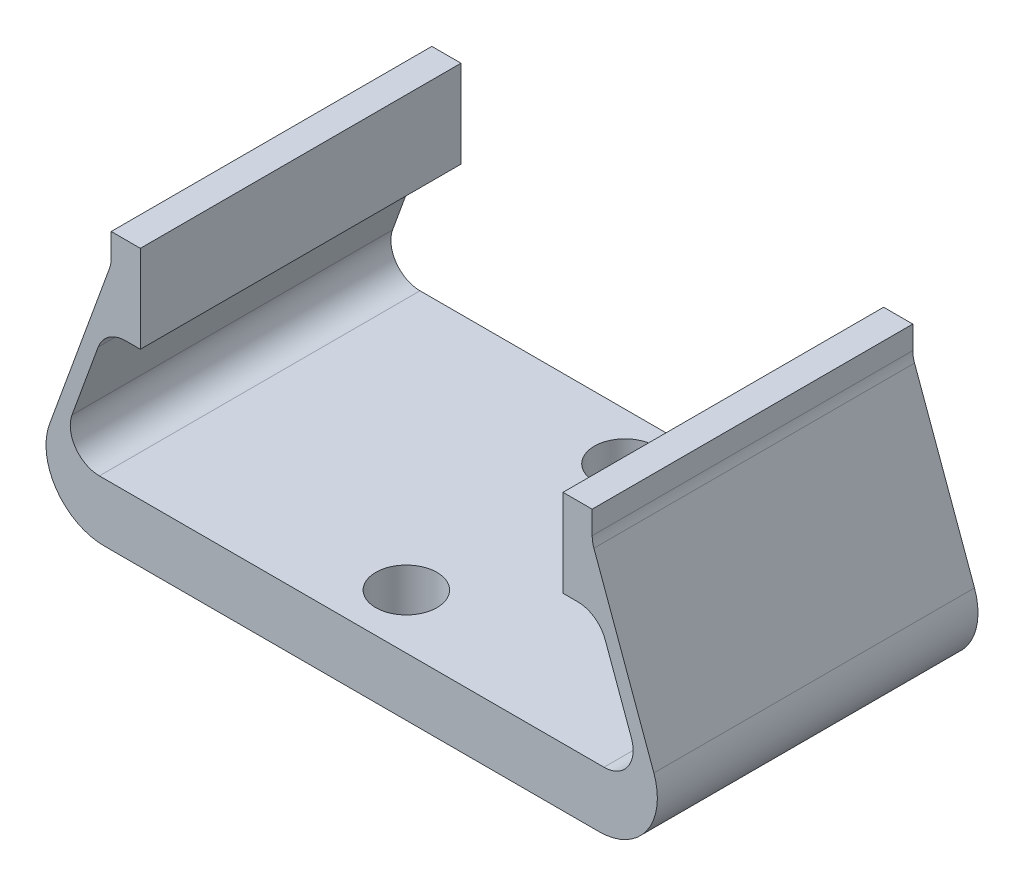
ISO-10303-21;
HEADER;
FILE_DESCRIPTION(('STEP AP214'),'2;1');
FILE_NAME('part.step','',(''),(''),'','','');
FILE_SCHEMA(('AUTOMOTIVE_DESIGN { 1 0 10303 214 1 1 1 1 }'));
ENDSEC;
DATA;
#1=APPLICATION_CONTEXT('core data for automotive mechanical design processes');
#2=APPLICATION_PROTOCOL_DEFINITION('international standard','automotive_design',2000,#1);
#3=PRODUCT_CONTEXT('',#1,'mechanical');
#4=PRODUCT('Part','Part','',(#3));
#5=PRODUCT_RELATED_PRODUCT_CATEGORY('part','',(#4));
#6=PRODUCT_DEFINITION_FORMATION('','',#4);
#7=PRODUCT_DEFINITION_CONTEXT('part definition',#1,'design');
#8=PRODUCT_DEFINITION('design','',#6,#7);
#9=PRODUCT_DEFINITION_SHAPE('','',#8);
#10=(LENGTH_UNIT() NAMED_UNIT(*) SI_UNIT(.MILLI.,.METRE.));
#11=(NAMED_UNIT(*) PLANE_ANGLE_UNIT() SI_UNIT($,.RADIAN.));
#12=(NAMED_UNIT(*) SI_UNIT($,.STERADIAN.) SOLID_ANGLE_UNIT());
#13=UNCERTAINTY_MEASURE_WITH_UNIT(LENGTH_MEASURE(1.E-05),#10,'distance_accuracy_value','');
#14=(GEOMETRIC_REPRESENTATION_CONTEXT(3) GLOBAL_UNCERTAINTY_ASSIGNED_CONTEXT((#13)) GLOBAL_UNIT_ASSIGNED_CONTEXT((#10,
#11,#12)) REPRESENTATION_CONTEXT('',''));
#15=CARTESIAN_POINT('',(0.,0.,0.));
#16=DIRECTION('',(0.,0.,1.));
#17=DIRECTION('',(1.,0.,0.));
#18=AXIS2_PLACEMENT_3D('',#15,#16,#17);
#19=CARTESIAN_POINT('',(0.,0.,22.));
#20=DIRECTION('',(0.,1.,0.));
#21=DIRECTION('',(0.,0.,1.));
#22=AXIS2_PLACEMENT_3D('',#19,#20,#21);
#23=PLANE('',#22);
#24=CARTESIAN_POINT('',(0.,0.,18.25));
#25=DIRECTION('',(0.,-1.,0.));
#26=DIRECTION('',(0.,0.,-1.));
#27=AXIS2_PLACEMENT_3D('',#24,#25,#26);
#28=CIRCLE('',#27,2.1);
#29=CARTESIAN_POINT('',(0.,0.,16.15));
#30=VERTEX_POINT('',#29);
#31=EDGE_CURVE('E362',#30,#30,#28,.T.);
#32=ORIENTED_EDGE('',*,*,#31,.F.);
#33=EDGE_LOOP('',(#32));
#34=FACE_BOUND('',#33,.T.);
#35=CARTESIAN_POINT('',(0.,0.,3.25));
#36=DIRECTION('',(0.,-1.,0.));
#37=DIRECTION('',(0.,0.,-1.));
#38=AXIS2_PLACEMENT_3D('',#35,#36,#37);
#39=CIRCLE('',#38,2.1);
#40=CARTESIAN_POINT('',(0.,0.,1.15));
#41=VERTEX_POINT('',#40);
#42=EDGE_CURVE('E354',#41,#41,#39,.T.);
#43=ORIENTED_EDGE('',*,*,#42,.F.);
#44=EDGE_LOOP('',(#43));
#45=FACE_BOUND('',#44,.T.);
#46=DIRECTION('',(1.,0.,0.));
#47=VECTOR('',#46,1.);
#48=CARTESIAN_POINT('',(0.,0.,22.));
#49=LINE('',#48,#47);
#50=CARTESIAN_POINT('',(-16.974901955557,0.,22.));
#51=VERTEX_POINT('',#50);
#52=CARTESIAN_POINT('',(16.974901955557,0.,22.));
#53=VERTEX_POINT('',#52);
#54=EDGE_CURVE('E240',#51,#53,#49,.T.);
#55=ORIENTED_EDGE('',*,*,#54,.F.);
#56=DIRECTION('',(0.,0.,-1.));
#57=VECTOR('',#56,1.);
#58=CARTESIAN_POINT('',(-16.974901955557,0.,0.));
#59=LINE('',#58,#57);
#60=CARTESIAN_POINT('',(-16.974901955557,0.,0.));
#61=VERTEX_POINT('',#60);
#62=EDGE_CURVE('E324',#51,#61,#59,.T.);
#63=ORIENTED_EDGE('',*,*,#62,.T.);
#64=DIRECTION('',(1.,0.,0.));
#65=VECTOR('',#64,1.);
#66=CARTESIAN_POINT('',(0.,0.,0.));
#67=LINE('',#66,#65);
#68=CARTESIAN_POINT('',(16.974901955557,0.,0.));
#69=VERTEX_POINT('',#68);
#70=EDGE_CURVE('E196',#61,#69,#67,.T.);
#71=ORIENTED_EDGE('',*,*,#70,.T.);
#72=DIRECTION('',(0.,0.,-1.));
#73=VECTOR('',#72,1.);
#74=CARTESIAN_POINT('',(16.974901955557,0.,22.));
#75=LINE('',#74,#73);
#76=EDGE_CURVE('E292',#69,#53,#75,.F.);
#77=ORIENTED_EDGE('',*,*,#76,.T.);
#78=EDGE_LOOP('',(#55,#63,#71,#77));
#79=FACE_BOUND('',#78,.T.);
#80=ADVANCED_FACE('F33',(#34,#45,#79),#23,.F.);
#81=CARTESIAN_POINT('',(22.6874939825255,0.,22.));
#82=DIRECTION('',(-0.939692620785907,-0.342020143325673,0.));
#83=DIRECTION('',(0.342020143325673,-0.939692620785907,0.));
#84=AXIS2_PLACEMENT_3D('',#81,#82,#83);
#85=PLANE('',#84);
#86=DIRECTION('',(-0.342020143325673,0.939692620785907,0.));
#87=VECTOR('',#86,1.);
#88=CARTESIAN_POINT('',(22.6874939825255,0.,0.));
#89=LINE('',#88,#87);
#90=CARTESIAN_POINT('',(20.7336724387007,5.36808057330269,0.));
#91=VERTEX_POINT('',#90);
#92=CARTESIAN_POINT('',(16.6206147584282,16.6686136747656,0.));
#93=VERTEX_POINT('',#92);
#94=EDGE_CURVE('E262',#91,#93,#89,.T.);
#95=ORIENTED_EDGE('',*,*,#94,.T.);
#96=DIRECTION('',(0.,0.,-1.));
#97=VECTOR('',#96,1.);
#98=CARTESIAN_POINT('',(16.6206147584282,16.6686136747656,22.));
#99=LINE('',#98,#97);
#100=CARTESIAN_POINT('',(16.6206147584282,16.6686136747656,22.));
#101=VERTEX_POINT('',#100);
#102=EDGE_CURVE('E300',#93,#101,#99,.F.);
#103=ORIENTED_EDGE('',*,*,#102,.T.);
#104=DIRECTION('',(-0.342020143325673,0.939692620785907,0.));
#105=VECTOR('',#104,1.);
#106=CARTESIAN_POINT('',(22.6874939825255,0.,22.));
#107=LINE('',#106,#105);
#108=CARTESIAN_POINT('',(20.7336724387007,5.36808057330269,22.));
#109=VERTEX_POINT('',#108);
#110=EDGE_CURVE('E242',#109,#101,#107,.T.);
#111=ORIENTED_EDGE('',*,*,#110,.F.);
#112=DIRECTION('',(0.,0.,-1.));
#113=VECTOR('',#112,1.);
#114=CARTESIAN_POINT('',(20.7336724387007,5.36808057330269,22.));
#115=LINE('',#114,#113);
#116=EDGE_CURVE('E286',#109,#91,#115,.T.);
#117=ORIENTED_EDGE('',*,*,#116,.T.);
#118=EDGE_LOOP('',(#95,#103,#111,#117));
#119=FACE_BOUND('',#118,.T.);
#120=ADVANCED_FACE('F415',(#119),#85,.F.);
#121=CARTESIAN_POINT('',(16.5,18.9299823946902,22.));
#122=DIRECTION('',(-1.,0.,0.));
#123=DIRECTION('',(0.,-1.,0.));
#124=AXIS2_PLACEMENT_3D('',#121,#122,#123);
#125=PLANE('',#124);
#126=DIRECTION('',(0.,1.,0.));
#127=VECTOR('',#126,1.);
#128=CARTESIAN_POINT('',(16.5,18.9299823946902,22.));
#129=LINE('',#128,#127);
#130=CARTESIAN_POINT('',(16.5,17.3526539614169,22.));
#131=VERTEX_POINT('',#130);
#132=CARTESIAN_POINT('',(16.5,18.9299823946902,22.));
#133=VERTEX_POINT('',#132);
#134=EDGE_CURVE('E246',#131,#133,#129,.T.);
#135=ORIENTED_EDGE('',*,*,#134,.F.);
#136=DIRECTION('',(0.,0.,-1.));
#137=VECTOR('',#136,1.);
#138=CARTESIAN_POINT('',(16.5,17.3526539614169,0.));
#139=LINE('',#138,#137);
#140=CARTESIAN_POINT('',(16.5,17.3526539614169,0.));
#141=VERTEX_POINT('',#140);
#142=EDGE_CURVE('E297',#131,#141,#139,.T.);
#143=ORIENTED_EDGE('',*,*,#142,.T.);
#144=DIRECTION('',(0.,1.,0.));
#145=VECTOR('',#144,1.);
#146=CARTESIAN_POINT('',(16.5,18.9299823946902,0.));
#147=LINE('',#146,#145);
#148=CARTESIAN_POINT('',(16.5,18.9299823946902,0.));
#149=VERTEX_POINT('',#148);
#150=EDGE_CURVE('E265',#141,#149,#147,.T.);
#151=ORIENTED_EDGE('',*,*,#150,.T.);
#152=DIRECTION('',(0.,0.,-1.));
#153=VECTOR('',#152,1.);
#154=CARTESIAN_POINT('',(16.5,18.9299823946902,22.));
#155=LINE('',#154,#153);
#156=EDGE_CURVE('E283',#133,#149,#155,.T.);
#157=ORIENTED_EDGE('',*,*,#156,.F.);
#158=EDGE_LOOP('',(#135,#143,#151,#157));
#159=FACE_BOUND('',#158,.T.);
#160=ADVANCED_FACE('F407',(#159),#125,.F.);
#161=CARTESIAN_POINT('',(14.5,18.9299823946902,22.));
#162=DIRECTION('',(0.,-1.,0.));
#163=DIRECTION('',(1.,0.,0.));
#164=AXIS2_PLACEMENT_3D('',#161,#162,#163);
#165=PLANE('',#164);
#166=DIRECTION('',(-1.,0.,0.));
#167=VECTOR('',#166,1.);
#168=CARTESIAN_POINT('',(14.5,18.9299823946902,0.));
#169=LINE('',#168,#167);
#170=CARTESIAN_POINT('',(14.5,18.9299823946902,0.));
#171=VERTEX_POINT('',#170);
#172=EDGE_CURVE('E267',#149,#171,#169,.T.);
#173=ORIENTED_EDGE('',*,*,#172,.T.);
#174=DIRECTION('',(0.,0.,-1.));
#175=VECTOR('',#174,1.);
#176=CARTESIAN_POINT('',(14.5,18.9299823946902,22.));
#177=LINE('',#176,#175);
#178=CARTESIAN_POINT('',(14.5,18.9299823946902,22.));
#179=VERTEX_POINT('',#178);
#180=EDGE_CURVE('E280',#179,#171,#177,.T.);
#181=ORIENTED_EDGE('',*,*,#180,.F.);
#182=DIRECTION('',(-1.,0.,0.));
#183=VECTOR('',#182,1.);
#184=CARTESIAN_POINT('',(14.5,18.9299823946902,22.));
#185=LINE('',#184,#183);
#186=EDGE_CURVE('E248',#133,#179,#185,.T.);
#187=ORIENTED_EDGE('',*,*,#186,.F.);
#188=ORIENTED_EDGE('',*,*,#156,.T.);
#189=EDGE_LOOP('',(#173,#181,#187,#188));
#190=FACE_BOUND('',#189,.T.);
#191=ADVANCED_FACE('F402',(#190),#165,.F.);
#192=CARTESIAN_POINT('',(14.5,12.9299823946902,22.));
#193=DIRECTION('',(1.,0.,0.));
#194=DIRECTION('',(0.,0.,-1.));
#195=AXIS2_PLACEMENT_3D('',#192,#193,#194);
#196=PLANE('',#195);
#197=DIRECTION('',(0.,-1.,0.));
#198=VECTOR('',#197,1.);
#199=CARTESIAN_POINT('',(14.5,12.9299823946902,0.));
#200=LINE('',#199,#198);
#201=CARTESIAN_POINT('',(14.5,12.9299823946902,0.));
#202=VERTEX_POINT('',#201);
#203=EDGE_CURVE('E269',#171,#202,#200,.T.);
#204=ORIENTED_EDGE('',*,*,#203,.T.);
#205=DIRECTION('',(0.,0.,-1.));
#206=VECTOR('',#205,1.);
#207=CARTESIAN_POINT('',(14.5,12.9299823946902,22.));
#208=LINE('',#207,#206);
#209=CARTESIAN_POINT('',(14.5,12.9299823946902,22.));
#210=VERTEX_POINT('',#209);
#211=EDGE_CURVE('E260',#210,#202,#208,.T.);
#212=ORIENTED_EDGE('',*,*,#211,.F.);
#213=DIRECTION('',(0.,-1.,0.));
#214=VECTOR('',#213,1.);
#215=CARTESIAN_POINT('',(14.5,12.9299823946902,22.));
#216=LINE('',#215,#214);
#217=EDGE_CURVE('E250',#179,#210,#216,.T.);
#218=ORIENTED_EDGE('',*,*,#217,.F.);
#219=ORIENTED_EDGE('',*,*,#180,.T.);
#220=EDGE_LOOP('',(#204,#212,#218,#219));
#221=FACE_BOUND('',#220,.T.);
#222=ADVANCED_FACE('F397',(#221),#196,.F.);
#223=CARTESIAN_POINT('',(14.5,12.9299823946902,22.));
#224=DIRECTION('',(0.,1.,0.));
#225=DIRECTION('',(0.,0.,1.));
#226=AXIS2_PLACEMENT_3D('',#223,#224,#225);
#227=PLANE('',#226);
#228=DIRECTION('',(1.,0.,0.));
#229=VECTOR('',#228,1.);
#230=CARTESIAN_POINT('',(14.5,12.9299823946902,0.));
#231=LINE('',#230,#229);
#232=CARTESIAN_POINT('',(15.5167724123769,12.9299823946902,0.));
#233=VERTEX_POINT('',#232);
#234=EDGE_CURVE('E271',#202,#233,#231,.T.);
#235=ORIENTED_EDGE('',*,*,#234,.T.);
#236=DIRECTION('',(0.,0.,-1.));
#237=VECTOR('',#236,1.);
#238=CARTESIAN_POINT('',(15.5167724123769,12.9299823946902,22.));
#239=LINE('',#238,#237);
#240=CARTESIAN_POINT('',(15.5167724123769,12.9299823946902,22.));
#241=VERTEX_POINT('',#240);
#242=EDGE_CURVE('E307',#233,#241,#239,.F.);
#243=ORIENTED_EDGE('',*,*,#242,.T.);
#244=DIRECTION('',(1.,0.,0.));
#245=VECTOR('',#244,1.);
#246=CARTESIAN_POINT('',(14.5,12.9299823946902,22.));
#247=LINE('',#246,#245);
#248=EDGE_CURVE('E252',#210,#241,#247,.T.);
#249=ORIENTED_EDGE('',*,*,#248,.F.);
#250=ORIENTED_EDGE('',*,*,#211,.T.);
#251=EDGE_LOOP('',(#235,#243,#249,#250));
#252=FACE_BOUND('',#251,.T.);
#253=ADVANCED_FACE('F392',(#252),#227,.F.);
#254=CARTESIAN_POINT('',(16.9171874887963,12.9299823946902,22.));
#255=DIRECTION('',(0.939692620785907,0.342020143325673,0.));
#256=DIRECTION('',(-0.342020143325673,0.939692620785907,0.));
#257=AXIS2_PLACEMENT_3D('',#254,#255,#256);
#258=PLANE('',#257);
#259=DIRECTION('',(0.342020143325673,-0.939692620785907,0.));
#260=VECTOR('',#259,1.);
#261=CARTESIAN_POINT('',(16.9171874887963,12.9299823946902,22.));
#262=LINE('',#261,#260);
#263=CARTESIAN_POINT('',(17.3961576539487,11.6140226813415,22.));
#264=VERTEX_POINT('',#263);
#265=CARTESIAN_POINT('',(19.1905245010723,6.68404028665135,22.));
#266=VERTEX_POINT('',#265);
#267=EDGE_CURVE('E255',#264,#266,#262,.T.);
#268=ORIENTED_EDGE('',*,*,#267,.F.);
#269=DIRECTION('',(0.,0.,-1.));
#270=VECTOR('',#269,1.);
#271=CARTESIAN_POINT('',(17.3961576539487,11.6140226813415,0.));
#272=LINE('',#271,#270);
#273=CARTESIAN_POINT('',(17.3961576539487,11.6140226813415,0.));
#274=VERTEX_POINT('',#273);
#275=EDGE_CURVE('E304',#264,#274,#272,.T.);
#276=ORIENTED_EDGE('',*,*,#275,.T.);
#277=DIRECTION('',(0.342020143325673,-0.939692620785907,0.));
#278=VECTOR('',#277,1.);
#279=CARTESIAN_POINT('',(16.9171874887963,12.9299823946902,0.));
#280=LINE('',#279,#278);
#281=CARTESIAN_POINT('',(19.1905245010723,6.68404028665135,0.));
#282=VERTEX_POINT('',#281);
#283=EDGE_CURVE('E274',#274,#282,#280,.T.);
#284=ORIENTED_EDGE('',*,*,#283,.T.);
#285=DIRECTION('',(0.,0.,-1.));
#286=VECTOR('',#285,1.);
#287=CARTESIAN_POINT('',(19.1905245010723,6.68404028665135,22.));
#288=LINE('',#287,#286);
#289=EDGE_CURVE('E302',#282,#266,#288,.F.);
#290=ORIENTED_EDGE('',*,*,#289,.T.);
#291=EDGE_LOOP('',(#268,#276,#284,#290));
#292=FACE_BOUND('',#291,.T.);
#293=ADVANCED_FACE('F383',(#292),#258,.F.);
#294=CARTESIAN_POINT('',(20.1674352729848,4.,22.));
#295=DIRECTION('',(0.,-1.,0.));
#296=DIRECTION('',(1.,0.,0.));
#297=AXIS2_PLACEMENT_3D('',#294,#295,#296);
#298=PLANE('',#297);
#299=CARTESIAN_POINT('',(0.,4.,18.25));
#300=DIRECTION('',(0.,-1.,0.));
#301=DIRECTION('',(1.,0.,0.));
#302=AXIS2_PLACEMENT_3D('',#299,#300,#301);
#303=CIRCLE('',#302,2.1);
#304=CARTESIAN_POINT('',(2.1,4.,18.25));
#305=VERTEX_POINT('',#304);
#306=EDGE_CURVE('E37',#305,#305,#303,.T.);
#307=ORIENTED_EDGE('',*,*,#306,.T.);
#308=EDGE_LOOP('',(#307));
#309=FACE_BOUND('',#308,.T.);
#310=CARTESIAN_POINT('',(0.,4.,3.25));
#311=DIRECTION('',(0.,-1.,0.));
#312=DIRECTION('',(1.,0.,0.));
#313=AXIS2_PLACEMENT_3D('',#310,#311,#312);
#314=CIRCLE('',#313,2.1);
#315=CARTESIAN_POINT('',(2.1,4.,3.25));
#316=VERTEX_POINT('',#315);
#317=EDGE_CURVE('E225',#316,#316,#314,.T.);
#318=ORIENTED_EDGE('',*,*,#317,.T.);
#319=EDGE_LOOP('',(#318));
#320=FACE_BOUND('',#319,.T.);
#321=DIRECTION('',(-1.,0.,0.));
#322=VECTOR('',#321,1.);
#323=CARTESIAN_POINT('',(20.1674352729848,4.,0.));
#324=LINE('',#323,#322);
#325=CARTESIAN_POINT('',(17.3111392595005,4.,0.));
#326=VERTEX_POINT('',#325);
#327=CARTESIAN_POINT('',(-17.3111392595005,4.,0.));
#328=VERTEX_POINT('',#327);
#329=EDGE_CURVE('E243',#326,#328,#324,.T.);
#330=ORIENTED_EDGE('',*,*,#329,.T.);
#331=DIRECTION('',(0.,0.,-1.));
#332=VECTOR('',#331,1.);
#333=CARTESIAN_POINT('',(-17.3111392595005,4.,22.));
#334=LINE('',#333,#332);
#335=CARTESIAN_POINT('',(-17.3111392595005,4.,22.));
#336=VERTEX_POINT('',#335);
#337=EDGE_CURVE('E56',#328,#336,#334,.F.);
#338=ORIENTED_EDGE('',*,*,#337,.T.);
#339=DIRECTION('',(-1.,0.,0.));
#340=VECTOR('',#339,1.);
#341=CARTESIAN_POINT('',(20.1674352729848,4.,22.));
#342=LINE('',#341,#340);
#343=CARTESIAN_POINT('',(17.3111392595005,4.,22.));
#344=VERTEX_POINT('',#343);
#345=EDGE_CURVE('E258',#344,#336,#342,.T.);
#346=ORIENTED_EDGE('',*,*,#345,.F.);
#347=DIRECTION('',(0.,0.,-1.));
#348=VECTOR('',#347,1.);
#349=CARTESIAN_POINT('',(17.3111392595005,4.,0.));
#350=LINE('',#349,#348);
#351=EDGE_CURVE('E309',#344,#326,#350,.T.);
#352=ORIENTED_EDGE('',*,*,#351,.T.);
#353=EDGE_LOOP('',(#330,#338,#346,#352));
#354=FACE_BOUND('',#353,.T.);
#355=ADVANCED_FACE('F374',(#309,#320,#354),#298,.F.);
#356=CARTESIAN_POINT('',(0.,0.,22.));
#357=DIRECTION('',(0.,0.,1.));
#358=DIRECTION('',(1.,0.,0.));
#359=AXIS2_PLACEMENT_3D('',#356,#357,#358);
#360=PLANE('',#359);
#361=DIRECTION('',(0.342020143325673,0.939692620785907,0.));
#362=VECTOR('',#361,1.);
#363=CARTESIAN_POINT('',(-22.6874939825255,0.,22.));
#364=LINE('',#363,#362);
#365=CARTESIAN_POINT('',(-20.7336724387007,5.36808057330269,22.));
#366=VERTEX_POINT('',#365);
#367=CARTESIAN_POINT('',(-16.6206147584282,16.6686136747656,22.));
#368=VERTEX_POINT('',#367);
#369=EDGE_CURVE('E219',#366,#368,#364,.T.);
#370=ORIENTED_EDGE('',*,*,#369,.F.);
#371=CARTESIAN_POINT('',(-16.974901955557,4.,22.));
#372=DIRECTION('',(0.,0.,1.));
#373=DIRECTION('',(1.,0.,0.));
#374=AXIS2_PLACEMENT_3D('',#371,#372,#373);
#375=CIRCLE('',#374,4.);
#376=EDGE_CURVE('E331',#366,#51,#375,.T.);
#377=ORIENTED_EDGE('',*,*,#376,.T.);
#378=ORIENTED_EDGE('',*,*,#54,.T.);
#379=CARTESIAN_POINT('',(16.974901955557,4.,22.));
#380=DIRECTION('',(0.,0.,1.));
#381=DIRECTION('',(1.,0.,0.));
#382=AXIS2_PLACEMENT_3D('',#379,#380,#381);
#383=CIRCLE('',#382,4.);
#384=EDGE_CURVE('E295',#53,#109,#383,.T.);
#385=ORIENTED_EDGE('',*,*,#384,.T.);
#386=ORIENTED_EDGE('',*,*,#110,.T.);
#387=CARTESIAN_POINT('',(18.5,17.3526539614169,22.));
#388=DIRECTION('',(0.,0.,1.));
#389=DIRECTION('',(1.,0.,0.));
#390=AXIS2_PLACEMENT_3D('',#387,#388,#389);
#391=CIRCLE('',#390,2.);
#392=EDGE_CURVE('E314',#101,#131,#391,.F.);
#393=ORIENTED_EDGE('',*,*,#392,.T.);
#394=ORIENTED_EDGE('',*,*,#134,.T.);
#395=ORIENTED_EDGE('',*,*,#186,.T.);
#396=ORIENTED_EDGE('',*,*,#217,.T.);
#397=ORIENTED_EDGE('',*,*,#248,.T.);
#398=CARTESIAN_POINT('',(15.5167724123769,10.9299823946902,22.));
#399=DIRECTION('',(0.,0.,1.));
#400=DIRECTION('',(1.,0.,0.));
#401=AXIS2_PLACEMENT_3D('',#398,#399,#400);
#402=CIRCLE('',#401,2.);
#403=EDGE_CURVE('E318',#241,#264,#402,.F.);
#404=ORIENTED_EDGE('',*,*,#403,.T.);
#405=ORIENTED_EDGE('',*,*,#267,.T.);
#406=CARTESIAN_POINT('',(17.3111392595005,6.,22.));
#407=DIRECTION('',(0.,0.,1.));
#408=DIRECTION('',(1.,0.,0.));
#409=AXIS2_PLACEMENT_3D('',#406,#407,#408);
#410=CIRCLE('',#409,2.);
#411=EDGE_CURVE('E322',#266,#344,#410,.F.);
#412=ORIENTED_EDGE('',*,*,#411,.T.);
#413=ORIENTED_EDGE('',*,*,#345,.T.);
#414=CARTESIAN_POINT('',(-17.3111392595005,6.,22.));
#415=DIRECTION('',(0.,0.,1.));
#416=DIRECTION('',(1.,0.,0.));
#417=AXIS2_PLACEMENT_3D('',#414,#415,#416);
#418=CIRCLE('',#417,2.);
#419=CARTESIAN_POINT('',(-19.1905245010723,6.68404028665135,22.));
#420=VERTEX_POINT('',#419);
#421=EDGE_CURVE('E11',#336,#420,#418,.F.);
#422=ORIENTED_EDGE('',*,*,#421,.T.);
#423=DIRECTION('',(-0.342020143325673,-0.939692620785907,0.));
#424=VECTOR('',#423,1.);
#425=CARTESIAN_POINT('',(-16.9171874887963,12.9299823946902,22.));
#426=LINE('',#425,#424);
#427=CARTESIAN_POINT('',(-17.3961576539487,11.6140226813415,22.));
#428=VERTEX_POINT('',#427);
#429=EDGE_CURVE('E209',#428,#420,#426,.T.);
#430=ORIENTED_EDGE('',*,*,#429,.F.);
#431=CARTESIAN_POINT('',(-15.5167724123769,10.9299823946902,22.));
#432=DIRECTION('',(0.,0.,1.));
#433=DIRECTION('',(1.,0.,0.));
#434=AXIS2_PLACEMENT_3D('',#431,#432,#433);
#435=CIRCLE('',#434,2.);
#436=CARTESIAN_POINT('',(-15.5167724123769,12.9299823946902,22.));
#437=VERTEX_POINT('',#436);
#438=EDGE_CURVE('E208',#428,#437,#435,.F.);
#439=ORIENTED_EDGE('',*,*,#438,.T.);
#440=DIRECTION('',(-1.,0.,0.));
#441=VECTOR('',#440,1.);
#442=CARTESIAN_POINT('',(-14.5,12.9299823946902,22.));
#443=LINE('',#442,#441);
#444=CARTESIAN_POINT('',(-14.5,12.9299823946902,22.));
#445=VERTEX_POINT('',#444);
#446=EDGE_CURVE('E188',#445,#437,#443,.T.);
#447=ORIENTED_EDGE('',*,*,#446,.F.);
#448=DIRECTION('',(0.,-1.,0.));
#449=VECTOR('',#448,1.);
#450=CARTESIAN_POINT('',(-14.5,12.9299823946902,22.));
#451=LINE('',#450,#449);
#452=CARTESIAN_POINT('',(-14.5,18.9299823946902,22.));
#453=VERTEX_POINT('',#452);
#454=EDGE_CURVE('E204',#453,#445,#451,.T.);
#455=ORIENTED_EDGE('',*,*,#454,.F.);
#456=DIRECTION('',(1.,0.,0.));
#457=VECTOR('',#456,1.);
#458=CARTESIAN_POINT('',(-14.5,18.9299823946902,22.));
#459=LINE('',#458,#457);
#460=CARTESIAN_POINT('',(-16.5,18.9299823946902,22.));
#461=VERTEX_POINT('',#460);
#462=EDGE_CURVE('E212',#461,#453,#459,.T.);
#463=ORIENTED_EDGE('',*,*,#462,.F.);
#464=DIRECTION('',(0.,1.,0.));
#465=VECTOR('',#464,1.);
#466=CARTESIAN_POINT('',(-16.5,18.9299823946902,22.));
#467=LINE('',#466,#465);
#468=CARTESIAN_POINT('',(-16.5,17.3526539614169,22.));
#469=VERTEX_POINT('',#468);
#470=EDGE_CURVE('E214',#469,#461,#467,.T.);
#471=ORIENTED_EDGE('',*,*,#470,.F.);
#472=CARTESIAN_POINT('',(-18.5,17.3526539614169,22.));
#473=DIRECTION('',(0.,0.,1.));
#474=DIRECTION('',(1.,0.,0.));
#475=AXIS2_PLACEMENT_3D('',#472,#473,#474);
#476=CIRCLE('',#475,2.);
#477=EDGE_CURVE('E348',#469,#368,#476,.F.);
#478=ORIENTED_EDGE('',*,*,#477,.T.);
#479=EDGE_LOOP('',(#370,#377,#378,#385,#386,#393,#394,#395,#396,#397,#404,#405,#412,#413,#422,
#430,#439,#447,#455,#463,#471,#478));
#480=FACE_BOUND('',#479,.T.);
#481=ADVANCED_FACE('F202',(#480),#360,.T.);
#482=CARTESIAN_POINT('',(0.,0.,0.));
#483=DIRECTION('',(0.,0.,1.));
#484=DIRECTION('',(1.,0.,0.));
#485=AXIS2_PLACEMENT_3D('',#482,#483,#484);
#486=PLANE('',#485);
#487=ORIENTED_EDGE('',*,*,#70,.F.);
#488=CARTESIAN_POINT('',(-16.974901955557,4.,0.));
#489=DIRECTION('',(0.,0.,1.));
#490=DIRECTION('',(1.,0.,0.));
#491=AXIS2_PLACEMENT_3D('',#488,#489,#490);
#492=CIRCLE('',#491,4.);
#493=CARTESIAN_POINT('',(-20.7336724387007,5.36808057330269,0.));
#494=VERTEX_POINT('',#493);
#495=EDGE_CURVE('E327',#61,#494,#492,.F.);
#496=ORIENTED_EDGE('',*,*,#495,.T.);
#497=DIRECTION('',(0.342020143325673,0.939692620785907,0.));
#498=VECTOR('',#497,1.);
#499=CARTESIAN_POINT('',(-22.6874939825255,0.,0.));
#500=LINE('',#499,#498);
#501=CARTESIAN_POINT('',(-16.6206147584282,16.6686136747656,0.));
#502=VERTEX_POINT('',#501);
#503=EDGE_CURVE('E234',#494,#502,#500,.T.);
#504=ORIENTED_EDGE('',*,*,#503,.T.);
#505=CARTESIAN_POINT('',(-18.5,17.3526539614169,0.));
#506=DIRECTION('',(0.,0.,1.));
#507=DIRECTION('',(1.,0.,0.));
#508=AXIS2_PLACEMENT_3D('',#505,#506,#507);
#509=CIRCLE('',#508,2.);
#510=CARTESIAN_POINT('',(-16.5,17.3526539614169,0.));
#511=VERTEX_POINT('',#510);
#512=EDGE_CURVE('E346',#502,#511,#509,.T.);
#513=ORIENTED_EDGE('',*,*,#512,.T.);
#514=DIRECTION('',(0.,1.,0.));
#515=VECTOR('',#514,1.);
#516=CARTESIAN_POINT('',(-16.5,18.9299823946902,0.));
#517=LINE('',#516,#515);
#518=CARTESIAN_POINT('',(-16.5,18.9299823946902,0.));
#519=VERTEX_POINT('',#518);
#520=EDGE_CURVE('E232',#511,#519,#517,.T.);
#521=ORIENTED_EDGE('',*,*,#520,.T.);
#522=DIRECTION('',(1.,0.,0.));
#523=VECTOR('',#522,1.);
#524=CARTESIAN_POINT('',(-14.5,18.9299823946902,0.));
#525=LINE('',#524,#523);
#526=CARTESIAN_POINT('',(-14.5,18.9299823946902,0.));
#527=VERTEX_POINT('',#526);
#528=EDGE_CURVE('E229',#519,#527,#525,.T.);
#529=ORIENTED_EDGE('',*,*,#528,.T.);
#530=DIRECTION('',(0.,-1.,0.));
#531=VECTOR('',#530,1.);
#532=CARTESIAN_POINT('',(-14.5,12.9299823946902,0.));
#533=LINE('',#532,#531);
#534=CARTESIAN_POINT('',(-14.5,12.9299823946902,0.));
#535=VERTEX_POINT('',#534);
#536=EDGE_CURVE('E227',#527,#535,#533,.T.);
#537=ORIENTED_EDGE('',*,*,#536,.T.);
#538=DIRECTION('',(-1.,0.,0.));
#539=VECTOR('',#538,1.);
#540=CARTESIAN_POINT('',(-14.5,12.9299823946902,0.));
#541=LINE('',#540,#539);
#542=CARTESIAN_POINT('',(-15.5167724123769,12.9299823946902,0.));
#543=VERTEX_POINT('',#542);
#544=EDGE_CURVE('E191',#535,#543,#541,.T.);
#545=ORIENTED_EDGE('',*,*,#544,.T.);
#546=CARTESIAN_POINT('',(-15.5167724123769,10.9299823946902,0.));
#547=DIRECTION('',(0.,0.,1.));
#548=DIRECTION('',(1.,0.,0.));
#549=AXIS2_PLACEMENT_3D('',#546,#547,#548);
#550=CIRCLE('',#549,2.);
#551=CARTESIAN_POINT('',(-17.3961576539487,11.6140226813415,0.));
#552=VERTEX_POINT('',#551);
#553=EDGE_CURVE('E350',#543,#552,#550,.T.);
#554=ORIENTED_EDGE('',*,*,#553,.T.);
#555=DIRECTION('',(-0.342020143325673,-0.939692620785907,0.));
#556=VECTOR('',#555,1.);
#557=CARTESIAN_POINT('',(-16.9171874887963,12.9299823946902,0.));
#558=LINE('',#557,#556);
#559=CARTESIAN_POINT('',(-19.1905245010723,6.68404028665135,0.));
#560=VERTEX_POINT('',#559);
#561=EDGE_CURVE('E223',#552,#560,#558,.T.);
#562=ORIENTED_EDGE('',*,*,#561,.T.);
#563=CARTESIAN_POINT('',(-17.3111392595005,6.,0.));
#564=DIRECTION('',(0.,0.,1.));
#565=DIRECTION('',(1.,0.,0.));
#566=AXIS2_PLACEMENT_3D('',#563,#564,#565);
#567=CIRCLE('',#566,2.);
#568=EDGE_CURVE('E42',#560,#328,#567,.T.);
#569=ORIENTED_EDGE('',*,*,#568,.T.);
#570=ORIENTED_EDGE('',*,*,#329,.F.);
#571=CARTESIAN_POINT('',(17.3111392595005,6.,0.));
#572=DIRECTION('',(0.,0.,1.));
#573=DIRECTION('',(1.,0.,0.));
#574=AXIS2_PLACEMENT_3D('',#571,#572,#573);
#575=CIRCLE('',#574,2.);
#576=EDGE_CURVE('E320',#326,#282,#575,.T.);
#577=ORIENTED_EDGE('',*,*,#576,.T.);
#578=ORIENTED_EDGE('',*,*,#283,.F.);
#579=CARTESIAN_POINT('',(15.5167724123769,10.9299823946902,0.));
#580=DIRECTION('',(0.,0.,1.));
#581=DIRECTION('',(1.,0.,0.));
#582=AXIS2_PLACEMENT_3D('',#579,#580,#581);
#583=CIRCLE('',#582,2.);
#584=EDGE_CURVE('E316',#274,#233,#583,.T.);
#585=ORIENTED_EDGE('',*,*,#584,.T.);
#586=ORIENTED_EDGE('',*,*,#234,.F.);
#587=ORIENTED_EDGE('',*,*,#203,.F.);
#588=ORIENTED_EDGE('',*,*,#172,.F.);
#589=ORIENTED_EDGE('',*,*,#150,.F.);
#590=CARTESIAN_POINT('',(18.5,17.3526539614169,0.));
#591=DIRECTION('',(0.,0.,1.));
#592=DIRECTION('',(1.,0.,0.));
#593=AXIS2_PLACEMENT_3D('',#590,#591,#592);
#594=CIRCLE('',#593,2.);
#595=EDGE_CURVE('E312',#141,#93,#594,.T.);
#596=ORIENTED_EDGE('',*,*,#595,.T.);
#597=ORIENTED_EDGE('',*,*,#94,.F.);
#598=CARTESIAN_POINT('',(16.974901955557,4.,0.));
#599=DIRECTION('',(0.,0.,1.));
#600=DIRECTION('',(1.,0.,0.));
#601=AXIS2_PLACEMENT_3D('',#598,#599,#600);
#602=CIRCLE('',#601,4.);
#603=EDGE_CURVE('E289',#91,#69,#602,.F.);
#604=ORIENTED_EDGE('',*,*,#603,.T.);
#605=EDGE_LOOP('',(#487,#496,#504,#513,#521,#529,#537,#545,#554,#562,#569,#570,#577,#578,#585,
#586,#587,#588,#589,#596,#597,#604));
#606=FACE_BOUND('',#605,.T.);
#607=ADVANCED_FACE('F380',(#606),#486,.F.);
#608=CARTESIAN_POINT('',(16.974901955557,4.,22.));
#609=DIRECTION('',(0.,0.,-1.));
#610=DIRECTION('',(-1.,0.,0.));
#611=AXIS2_PLACEMENT_3D('',#608,#609,#610);
#612=CYLINDRICAL_SURFACE('',#611,4.);
#613=ORIENTED_EDGE('',*,*,#384,.F.);
#614=ORIENTED_EDGE('',*,*,#76,.F.);
#615=ORIENTED_EDGE('',*,*,#603,.F.);
#616=ORIENTED_EDGE('',*,*,#116,.F.);
#617=EDGE_LOOP('',(#613,#614,#615,#616));
#618=FACE_BOUND('',#617,.T.);
#619=ADVANCED_FACE('F420',(#618),#612,.T.);
#620=CARTESIAN_POINT('',(18.5,17.3526539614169,22.));
#621=DIRECTION('',(0.,0.,1.));
#622=DIRECTION('',(1.,0.,0.));
#623=AXIS2_PLACEMENT_3D('',#620,#621,#622);
#624=CYLINDRICAL_SURFACE('',#623,2.);
#625=ORIENTED_EDGE('',*,*,#392,.F.);
#626=ORIENTED_EDGE('',*,*,#102,.F.);
#627=ORIENTED_EDGE('',*,*,#595,.F.);
#628=ORIENTED_EDGE('',*,*,#142,.F.);
#629=EDGE_LOOP('',(#625,#626,#627,#628));
#630=FACE_BOUND('',#629,.T.);
#631=ADVANCED_FACE('F411',(#630),#624,.F.);
#632=CARTESIAN_POINT('',(15.5167724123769,10.9299823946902,22.));
#633=DIRECTION('',(0.,0.,1.));
#634=DIRECTION('',(1.,0.,0.));
#635=AXIS2_PLACEMENT_3D('',#632,#633,#634);
#636=CYLINDRICAL_SURFACE('',#635,2.);
#637=ORIENTED_EDGE('',*,*,#403,.F.);
#638=ORIENTED_EDGE('',*,*,#242,.F.);
#639=ORIENTED_EDGE('',*,*,#584,.F.);
#640=ORIENTED_EDGE('',*,*,#275,.F.);
#641=EDGE_LOOP('',(#637,#638,#639,#640));
#642=FACE_BOUND('',#641,.T.);
#643=ADVANCED_FACE('F387',(#642),#636,.F.);
#644=CARTESIAN_POINT('',(17.3111392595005,6.,22.));
#645=DIRECTION('',(0.,0.,1.));
#646=DIRECTION('',(1.,0.,0.));
#647=AXIS2_PLACEMENT_3D('',#644,#645,#646);
#648=CYLINDRICAL_SURFACE('',#647,2.);
#649=ORIENTED_EDGE('',*,*,#411,.F.);
#650=ORIENTED_EDGE('',*,*,#289,.F.);
#651=ORIENTED_EDGE('',*,*,#576,.F.);
#652=ORIENTED_EDGE('',*,*,#351,.F.);
#653=EDGE_LOOP('',(#649,#650,#651,#652));
#654=FACE_BOUND('',#653,.T.);
#655=ADVANCED_FACE('F376',(#654),#648,.F.);
#656=CARTESIAN_POINT('',(-16.9171874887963,12.9299823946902,22.));
#657=DIRECTION('',(0.939692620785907,-0.342020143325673,0.));
#658=DIRECTION('',(0.342020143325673,0.939692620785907,0.));
#659=AXIS2_PLACEMENT_3D('',#656,#657,#658);
#660=PLANE('',#659);
#661=ORIENTED_EDGE('',*,*,#561,.F.);
#662=DIRECTION('',(0.,0.,-1.));
#663=VECTOR('',#662,1.);
#664=CARTESIAN_POINT('',(-17.3961576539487,11.6140226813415,22.));
#665=LINE('',#664,#663);
#666=EDGE_CURVE('E343',#552,#428,#665,.F.);
#667=ORIENTED_EDGE('',*,*,#666,.T.);
#668=ORIENTED_EDGE('',*,*,#429,.T.);
#669=DIRECTION('',(0.,0.,-1.));
#670=VECTOR('',#669,1.);
#671=CARTESIAN_POINT('',(-19.1905245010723,6.68404028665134,22.));
#672=LINE('',#671,#670);
#673=EDGE_CURVE('E340',#420,#560,#672,.T.);
#674=ORIENTED_EDGE('',*,*,#673,.T.);
#675=EDGE_LOOP('',(#661,#667,#668,#674));
#676=FACE_BOUND('',#675,.T.);
#677=ADVANCED_FACE('F368',(#676),#660,.T.);
#678=CARTESIAN_POINT('',(-14.5,12.9299823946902,22.));
#679=DIRECTION('',(0.,-1.,0.));
#680=DIRECTION('',(0.,0.,-1.));
#681=AXIS2_PLACEMENT_3D('',#678,#679,#680);
#682=PLANE('',#681);
#683=ORIENTED_EDGE('',*,*,#446,.T.);
#684=DIRECTION('',(0.,0.,-1.));
#685=VECTOR('',#684,1.);
#686=CARTESIAN_POINT('',(-15.5167724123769,12.9299823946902,0.));
#687=LINE('',#686,#685);
#688=EDGE_CURVE('E338',#437,#543,#687,.T.);
#689=ORIENTED_EDGE('',*,*,#688,.T.);
#690=ORIENTED_EDGE('',*,*,#544,.F.);
#691=DIRECTION('',(0.,0.,-1.));
#692=VECTOR('',#691,1.);
#693=CARTESIAN_POINT('',(-14.5,12.9299823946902,22.));
#694=LINE('',#693,#692);
#695=EDGE_CURVE('E184',#445,#535,#694,.T.);
#696=ORIENTED_EDGE('',*,*,#695,.F.);
#697=EDGE_LOOP('',(#683,#689,#690,#696));
#698=FACE_BOUND('',#697,.T.);
#699=ADVANCED_FACE('F186',(#698),#682,.T.);
#700=CARTESIAN_POINT('',(-14.5,12.9299823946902,22.));
#701=DIRECTION('',(1.,0.,0.));
#702=DIRECTION('',(0.,0.,-1.));
#703=AXIS2_PLACEMENT_3D('',#700,#701,#702);
#704=PLANE('',#703);
#705=ORIENTED_EDGE('',*,*,#536,.F.);
#706=DIRECTION('',(0.,0.,-1.));
#707=VECTOR('',#706,1.);
#708=CARTESIAN_POINT('',(-14.5,18.9299823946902,22.));
#709=LINE('',#708,#707);
#710=EDGE_CURVE('E197',#453,#527,#709,.T.);
#711=ORIENTED_EDGE('',*,*,#710,.F.);
#712=ORIENTED_EDGE('',*,*,#454,.T.);
#713=ORIENTED_EDGE('',*,*,#695,.T.);
#714=EDGE_LOOP('',(#705,#711,#712,#713));
#715=FACE_BOUND('',#714,.T.);
#716=ADVANCED_FACE('F211',(#715),#704,.T.);
#717=CARTESIAN_POINT('',(-14.5,18.9299823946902,22.));
#718=DIRECTION('',(0.,1.,0.));
#719=DIRECTION('',(-1.,0.,0.));
#720=AXIS2_PLACEMENT_3D('',#717,#718,#719);
#721=PLANE('',#720);
#722=ORIENTED_EDGE('',*,*,#528,.F.);
#723=DIRECTION('',(0.,0.,-1.));
#724=VECTOR('',#723,1.);
#725=CARTESIAN_POINT('',(-16.5,18.9299823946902,22.));
#726=LINE('',#725,#724);
#727=EDGE_CURVE('E222',#461,#519,#726,.T.);
#728=ORIENTED_EDGE('',*,*,#727,.F.);
#729=ORIENTED_EDGE('',*,*,#462,.T.);
#730=ORIENTED_EDGE('',*,*,#710,.T.);
#731=EDGE_LOOP('',(#722,#728,#729,#730));
#732=FACE_BOUND('',#731,.T.);
#733=ADVANCED_FACE('F444',(#732),#721,.T.);
#734=CARTESIAN_POINT('',(-16.5,18.9299823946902,22.));
#735=DIRECTION('',(-1.,0.,0.));
#736=DIRECTION('',(0.,-1.,0.));
#737=AXIS2_PLACEMENT_3D('',#734,#735,#736);
#738=PLANE('',#737);
#739=ORIENTED_EDGE('',*,*,#520,.F.);
#740=DIRECTION('',(0.,0.,-1.));
#741=VECTOR('',#740,1.);
#742=CARTESIAN_POINT('',(-16.5,17.3526539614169,22.));
#743=LINE('',#742,#741);
#744=EDGE_CURVE('E336',#511,#469,#743,.F.);
#745=ORIENTED_EDGE('',*,*,#744,.T.);
#746=ORIENTED_EDGE('',*,*,#470,.T.);
#747=ORIENTED_EDGE('',*,*,#727,.T.);
#748=EDGE_LOOP('',(#739,#745,#746,#747));
#749=FACE_BOUND('',#748,.T.);
#750=ADVANCED_FACE('F440',(#749),#738,.T.);
#751=CARTESIAN_POINT('',(-22.6874939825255,0.,22.));
#752=DIRECTION('',(-0.939692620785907,0.342020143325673,0.));
#753=DIRECTION('',(-0.342020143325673,-0.939692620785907,0.));
#754=AXIS2_PLACEMENT_3D('',#751,#752,#753);
#755=PLANE('',#754);
#756=ORIENTED_EDGE('',*,*,#369,.T.);
#757=DIRECTION('',(0.,0.,-1.));
#758=VECTOR('',#757,1.);
#759=CARTESIAN_POINT('',(-16.6206147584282,16.6686136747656,0.));
#760=LINE('',#759,#758);
#761=EDGE_CURVE('E333',#368,#502,#760,.T.);
#762=ORIENTED_EDGE('',*,*,#761,.T.);
#763=ORIENTED_EDGE('',*,*,#503,.F.);
#764=DIRECTION('',(0.,0.,-1.));
#765=VECTOR('',#764,1.);
#766=CARTESIAN_POINT('',(-20.7336724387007,5.36808057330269,22.));
#767=LINE('',#766,#765);
#768=EDGE_CURVE('E329',#494,#366,#767,.F.);
#769=ORIENTED_EDGE('',*,*,#768,.T.);
#770=EDGE_LOOP('',(#756,#762,#763,#769));
#771=FACE_BOUND('',#770,.T.);
#772=ADVANCED_FACE('F431',(#771),#755,.T.);
#773=CARTESIAN_POINT('',(-16.974901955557,4.,22.));
#774=DIRECTION('',(0.,0.,1.));
#775=DIRECTION('',(1.,0.,0.));
#776=AXIS2_PLACEMENT_3D('',#773,#774,#775);
#777=CYLINDRICAL_SURFACE('',#776,4.);
#778=ORIENTED_EDGE('',*,*,#376,.F.);
#779=ORIENTED_EDGE('',*,*,#768,.F.);
#780=ORIENTED_EDGE('',*,*,#495,.F.);
#781=ORIENTED_EDGE('',*,*,#62,.F.);
#782=EDGE_LOOP('',(#778,#779,#780,#781));
#783=FACE_BOUND('',#782,.T.);
#784=ADVANCED_FACE('F428',(#783),#777,.T.);
#785=CARTESIAN_POINT('',(-18.5,17.3526539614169,22.));
#786=DIRECTION('',(0.,0.,1.));
#787=DIRECTION('',(1.,0.,0.));
#788=AXIS2_PLACEMENT_3D('',#785,#786,#787);
#789=CYLINDRICAL_SURFACE('',#788,2.);
#790=ORIENTED_EDGE('',*,*,#477,.F.);
#791=ORIENTED_EDGE('',*,*,#744,.F.);
#792=ORIENTED_EDGE('',*,*,#512,.F.);
#793=ORIENTED_EDGE('',*,*,#761,.F.);
#794=EDGE_LOOP('',(#790,#791,#792,#793));
#795=FACE_BOUND('',#794,.T.);
#796=ADVANCED_FACE('F437',(#795),#789,.F.);
#797=CARTESIAN_POINT('',(-15.5167724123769,10.9299823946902,22.));
#798=DIRECTION('',(0.,0.,1.));
#799=DIRECTION('',(1.,0.,0.));
#800=AXIS2_PLACEMENT_3D('',#797,#798,#799);
#801=CYLINDRICAL_SURFACE('',#800,2.);
#802=ORIENTED_EDGE('',*,*,#438,.F.);
#803=ORIENTED_EDGE('',*,*,#666,.F.);
#804=ORIENTED_EDGE('',*,*,#553,.F.);
#805=ORIENTED_EDGE('',*,*,#688,.F.);
#806=EDGE_LOOP('',(#802,#803,#804,#805));
#807=FACE_BOUND('',#806,.T.);
#808=ADVANCED_FACE('F446',(#807),#801,.F.);
#809=CARTESIAN_POINT('',(-17.3111392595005,6.,22.));
#810=DIRECTION('',(0.,0.,-1.));
#811=DIRECTION('',(-1.,0.,0.));
#812=AXIS2_PLACEMENT_3D('',#809,#810,#811);
#813=CYLINDRICAL_SURFACE('',#812,2.);
#814=ORIENTED_EDGE('',*,*,#421,.F.);
#815=ORIENTED_EDGE('',*,*,#337,.F.);
#816=ORIENTED_EDGE('',*,*,#568,.F.);
#817=ORIENTED_EDGE('',*,*,#673,.F.);
#818=EDGE_LOOP('',(#814,#815,#816,#817));
#819=FACE_BOUND('',#818,.T.);
#820=ADVANCED_FACE('F35',(#819),#813,.F.);
#821=CARTESIAN_POINT('',(0.,18.9299823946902,3.25));
#822=DIRECTION('',(0.,-1.,0.));
#823=DIRECTION('',(0.,0.,-1.));
#824=AXIS2_PLACEMENT_3D('',#821,#822,#823);
#825=CYLINDRICAL_SURFACE('',#824,2.1);
#826=ORIENTED_EDGE('',*,*,#42,.T.);
#827=EDGE_LOOP('',(#826));
#828=FACE_BOUND('',#827,.T.);
#829=ORIENTED_EDGE('',*,*,#317,.F.);
#830=EDGE_LOOP('',(#829));
#831=FACE_BOUND('',#830,.T.);
#832=ADVANCED_FACE('F452',(#828,#831),#825,.F.);
#833=CARTESIAN_POINT('',(0.,18.9299823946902,18.25));
#834=DIRECTION('',(0.,-1.,0.));
#835=DIRECTION('',(0.,0.,-1.));
#836=AXIS2_PLACEMENT_3D('',#833,#834,#835);
#837=CYLINDRICAL_SURFACE('',#836,2.1);
#838=ORIENTED_EDGE('',*,*,#31,.T.);
#839=EDGE_LOOP('',(#838));
#840=FACE_BOUND('',#839,.T.);
#841=ORIENTED_EDGE('',*,*,#306,.F.);
#842=EDGE_LOOP('',(#841));
#843=FACE_BOUND('',#842,.T.);
#844=ADVANCED_FACE('F661',(#840,#843),#837,.F.);
#845=CLOSED_SHELL('',(#80,#120,#160,#191,#222,#253,#293,#355,#481,#607,#619,#631,#643,#655,#677,
#699,#716,#733,#750,#772,#784,#796,#808,#820,#832,#844));
#846=MANIFOLD_SOLID_BREP('B2',#845);
#847=ADVANCED_BREP_SHAPE_REPRESENTATION('',(#18,#846),#14);
#848=SHAPE_DEFINITION_REPRESENTATION(#9,#847);
ENDSEC;
END-ISO-10303-21;
